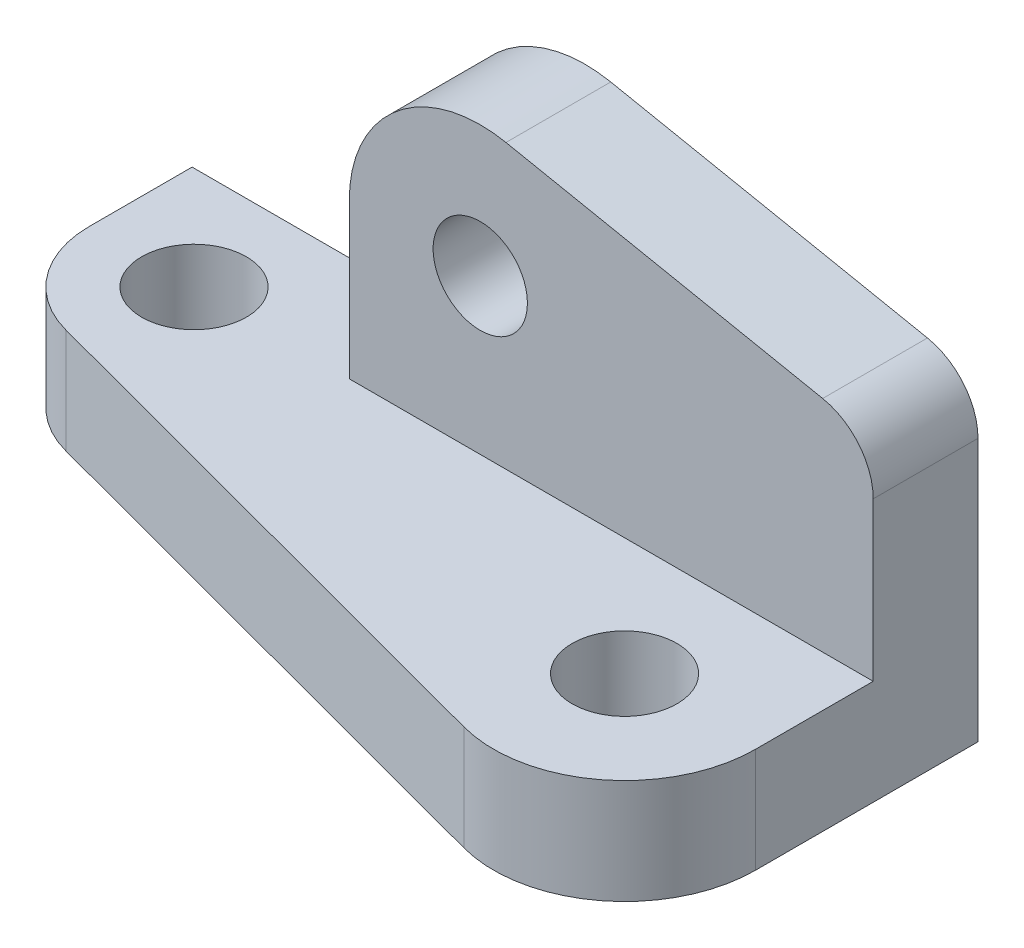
from build123d import *

# Parameters (mm, degrees)
BOSS_EXTRUDE1_DEPTH        = 20
BOSS_EXTRUDE2_DEPTH        = 20
FILLET1_R                  = 20
FILLET2_R                  = 25
FILLET3_R                  = 12
F_20_0_20_DIAMETER_HOLE1_D = 20
F_18_0_18_DIAMETER_HOLE1_D = 18


with BuildPart() as part:
    # Sketch1 → Boss-Extrude1 (new body)
    with BuildSketch(Plane(origin=(0, 0, 0), x_dir=(1, 0, 0), z_dir=(0, 1, 0))):
        Polygon((0, 0), (150, 0), (150, -75), (0, -35), align=None)
    extrude(amount=BOSS_EXTRUDE1_DEPTH)

    # Sketch2 → Boss-Extrude2 (add)
    with BuildSketch(Plane(origin=(0, 0, 0), x_dir=(-1, 0, 0), z_dir=(0, 0, -1))):
        Polygon((-50, 0), (-150, 0), (-150, 60), (-50, 80), align=None)
    extrude(amount=-BOSS_EXTRUDE2_DEPTH)

    # Fillet1
    fillet1_edges = [part.edges().sort_by_distance(p)[0] for p in [
        (0, 10, 35),
    ]]
    fillet(fillet1_edges, radius=FILLET1_R)

    # Fillet2
    fillet2_edges = [part.edges().sort_by_distance(p)[0] for p in [
        (50, 80, 10),
        (150, 10, 75),
    ]]
    fillet(fillet2_edges, radius=FILLET2_R)

    # Fillet3
    fillet3_edges = [part.edges().sort_by_distance(p)[0] for p in [
        (150, 60, 10),
    ]]
    fillet(fillet3_edges, radius=FILLET3_R)

    # 20.0 _20_ Diameter Hole1 (through all)
    with Locations(Plane(origin=(0, 20, 0), x_dir=(1, 0, 0), z_dir=(0, 1, 0))):
        with Locations((20, -19.634433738), (125, -42.45970884)):
            Hole(F_20_0_20_DIAMETER_HOLE1_D / 2)

    # 18.0 _18_ Diameter Hole1 (through all)
    with Locations(Plane.XY.offset(20)):
        with Locations((75, 49.504902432)):
            Hole(F_18_0_18_DIAMETER_HOLE1_D / 2)


solid = part.part
